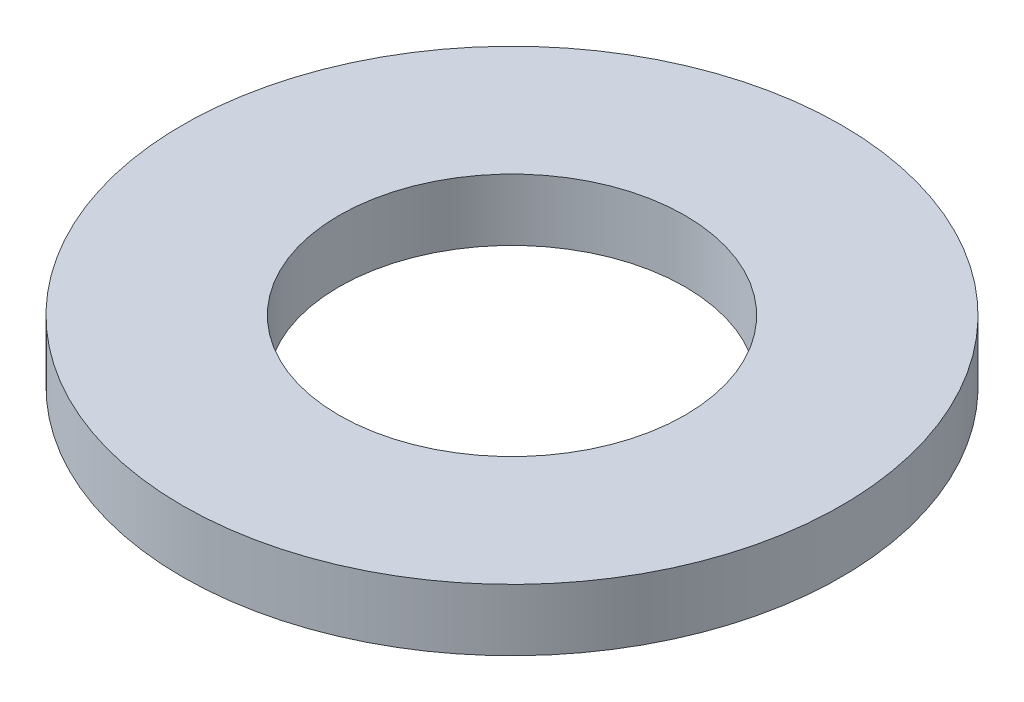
from build123d import *

# Parameters (mm, degrees)
ESQUISSE1_W = 3.8
ESQUISSE1_H = 1.5


with BuildPart() as part:
    # Esquisse1 → Base-R_volution (revolve)
    with BuildSketch(Plane.XY, mode=Mode.PRIVATE) as base_r_volution_sk:
        with Locations((6.1, 0.75)):
            Rectangle(ESQUISSE1_W, ESQUISSE1_H)
    revolve(base_r_volution_sk.sketch.rotate(Axis((0, 0, 0), (0, 1, 0)), 90), axis=Axis((0, 0, 0), (0, 1, 0)))


solid = part.part
